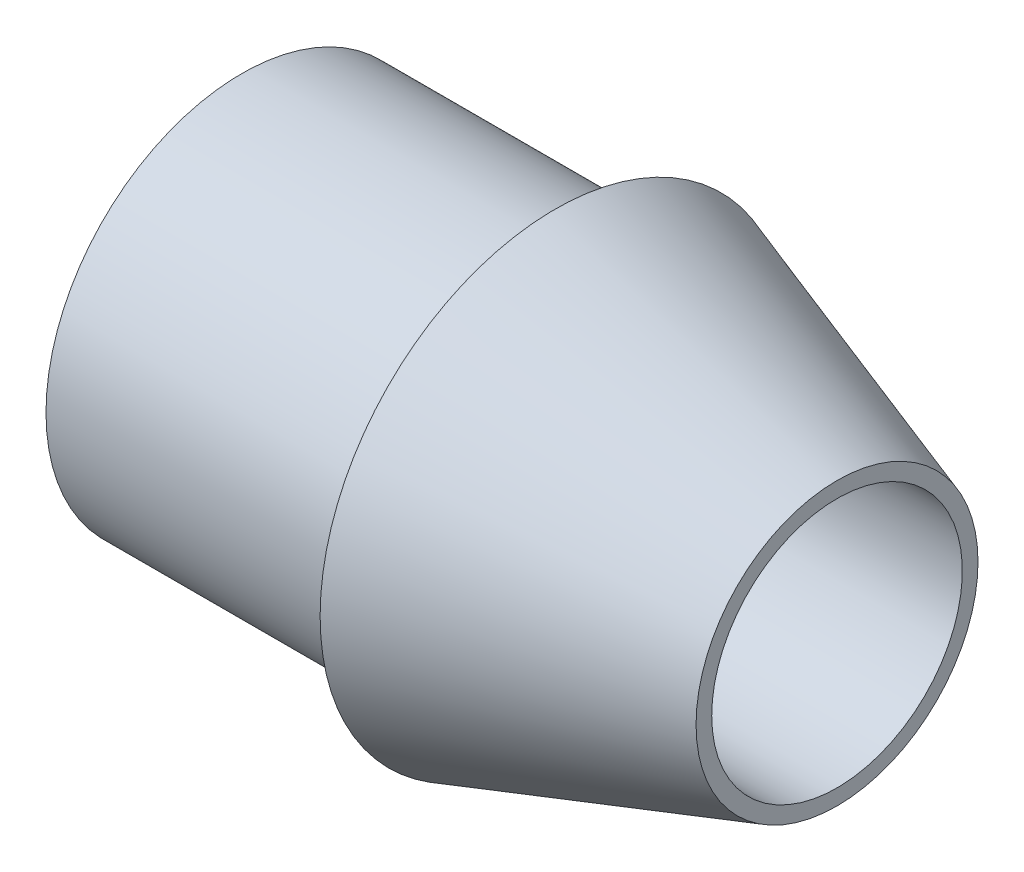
ISO-10303-21;
HEADER;
FILE_DESCRIPTION(('STEP AP214'),'2;1');
FILE_NAME('part.step','',(''),(''),'','','');
FILE_SCHEMA(('AUTOMOTIVE_DESIGN { 1 0 10303 214 1 1 1 1 }'));
ENDSEC;
DATA;
#1=APPLICATION_CONTEXT('core data for automotive mechanical design processes');
#2=APPLICATION_PROTOCOL_DEFINITION('international standard','automotive_design',2000,#1);
#3=PRODUCT_CONTEXT('',#1,'mechanical');
#4=PRODUCT('Part','Part','',(#3));
#5=PRODUCT_RELATED_PRODUCT_CATEGORY('part','',(#4));
#6=PRODUCT_DEFINITION_FORMATION('','',#4);
#7=PRODUCT_DEFINITION_CONTEXT('part definition',#1,'design');
#8=PRODUCT_DEFINITION('design','',#6,#7);
#9=PRODUCT_DEFINITION_SHAPE('','',#8);
#10=(LENGTH_UNIT() NAMED_UNIT(*) SI_UNIT(.MILLI.,.METRE.));
#11=(NAMED_UNIT(*) PLANE_ANGLE_UNIT() SI_UNIT($,.RADIAN.));
#12=(NAMED_UNIT(*) SI_UNIT($,.STERADIAN.) SOLID_ANGLE_UNIT());
#13=UNCERTAINTY_MEASURE_WITH_UNIT(LENGTH_MEASURE(1.E-05),#10,'distance_accuracy_value','');
#14=(GEOMETRIC_REPRESENTATION_CONTEXT(3) GLOBAL_UNCERTAINTY_ASSIGNED_CONTEXT((#13)) GLOBAL_UNIT_ASSIGNED_CONTEXT((#10,
#11,#12)) REPRESENTATION_CONTEXT('',''));
#15=CARTESIAN_POINT('',(0.,0.,0.));
#16=DIRECTION('',(0.,0.,1.));
#17=DIRECTION('',(1.,0.,0.));
#18=AXIS2_PLACEMENT_3D('',#15,#16,#17);
#19=CARTESIAN_POINT('',(-22.5,0.,0.));
#20=DIRECTION('',(1.,0.,0.));
#21=DIRECTION('',(0.,0.,-1.));
#22=AXIS2_PLACEMENT_3D('',#19,#20,#21);
#23=PLANE('',#22);
#24=CARTESIAN_POINT('',(-22.5,0.,0.));
#25=DIRECTION('',(-1.,0.,0.));
#26=DIRECTION('',(0.,0.,1.));
#27=AXIS2_PLACEMENT_3D('',#24,#25,#26);
#28=CIRCLE('',#27,7.5);
#29=CARTESIAN_POINT('',(-22.5,0.,7.5));
#30=VERTEX_POINT('',#29);
#31=EDGE_CURVE('E36',#30,#30,#28,.T.);
#32=ORIENTED_EDGE('',*,*,#31,.T.);
#33=EDGE_LOOP('',(#32));
#34=FACE_BOUND('',#33,.T.);
#35=CARTESIAN_POINT('',(-22.5,0.,0.));
#36=DIRECTION('',(1.,0.,0.));
#37=DIRECTION('',(0.,0.,-1.));
#38=AXIS2_PLACEMENT_3D('',#35,#36,#37);
#39=CIRCLE('',#38,6.25);
#40=CARTESIAN_POINT('',(-22.5,0.,-6.25));
#41=VERTEX_POINT('',#40);
#42=EDGE_CURVE('E10',#41,#41,#39,.F.);
#43=ORIENTED_EDGE('',*,*,#42,.F.);
#44=EDGE_LOOP('',(#43));
#45=FACE_BOUND('',#44,.T.);
#46=ADVANCED_FACE('F29',(#34,#45),#23,.F.);
#47=CARTESIAN_POINT('',(0.,0.,0.));
#48=DIRECTION('',(-1.,0.,0.));
#49=DIRECTION('',(0.,0.,1.));
#50=AXIS2_PLACEMENT_3D('',#47,#48,#49);
#51=CONICAL_SURFACE('',#50,0.,0.321750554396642);
#52=ORIENTED_EDGE('',*,*,#31,.F.);
#53=EDGE_LOOP('',(#52));
#54=FACE_BOUND('',#53,.T.);
#55=CARTESIAN_POINT('',(-13.5,0.,0.));
#56=DIRECTION('',(1.,0.,0.));
#57=DIRECTION('',(0.,0.,-1.));
#58=AXIS2_PLACEMENT_3D('',#55,#56,#57);
#59=CIRCLE('',#58,4.5);
#60=CARTESIAN_POINT('',(-13.5,0.,-4.5));
#61=VERTEX_POINT('',#60);
#62=EDGE_CURVE('E40',#61,#61,#59,.T.);
#63=ORIENTED_EDGE('',*,*,#62,.F.);
#64=EDGE_LOOP('',(#63));
#65=FACE_BOUND('',#64,.T.);
#66=ADVANCED_FACE('F31',(#54,#65),#51,.T.);
#67=CARTESIAN_POINT('',(-13.5,0.,0.));
#68=DIRECTION('',(1.,0.,0.));
#69=DIRECTION('',(0.,0.,-1.));
#70=AXIS2_PLACEMENT_3D('',#67,#68,#69);
#71=PLANE('',#70);
#72=CARTESIAN_POINT('',(-13.5,0.,0.));
#73=DIRECTION('',(-1.,0.,0.));
#74=DIRECTION('',(0.,0.,1.));
#75=AXIS2_PLACEMENT_3D('',#72,#73,#74);
#76=CIRCLE('',#75,4.);
#77=CARTESIAN_POINT('',(-13.5,0.,4.));
#78=VERTEX_POINT('',#77);
#79=EDGE_CURVE('E49',#78,#78,#76,.T.);
#80=ORIENTED_EDGE('',*,*,#79,.T.);
#81=EDGE_LOOP('',(#80));
#82=FACE_BOUND('',#81,.T.);
#83=ORIENTED_EDGE('',*,*,#62,.T.);
#84=EDGE_LOOP('',(#83));
#85=FACE_BOUND('',#84,.T.);
#86=ADVANCED_FACE('F66',(#82,#85),#71,.T.);
#87=CARTESIAN_POINT('',(-32.5,0.,0.));
#88=DIRECTION('',(1.,0.,0.));
#89=DIRECTION('',(0.,0.,-1.));
#90=AXIS2_PLACEMENT_3D('',#87,#88,#89);
#91=CYLINDRICAL_SURFACE('',#90,6.25);
#92=CARTESIAN_POINT('',(-32.5,0.,0.));
#93=DIRECTION('',(-1.,0.,0.));
#94=DIRECTION('',(0.,0.,1.));
#95=AXIS2_PLACEMENT_3D('',#92,#93,#94);
#96=CIRCLE('',#95,6.25);
#97=CARTESIAN_POINT('',(-32.5,0.,6.25));
#98=VERTEX_POINT('',#97);
#99=EDGE_CURVE('E45',#98,#98,#96,.T.);
#100=ORIENTED_EDGE('',*,*,#99,.F.);
#101=EDGE_LOOP('',(#100));
#102=FACE_BOUND('',#101,.T.);
#103=ORIENTED_EDGE('',*,*,#42,.T.);
#104=EDGE_LOOP('',(#103));
#105=FACE_BOUND('',#104,.T.);
#106=ADVANCED_FACE('F61',(#102,#105),#91,.T.);
#107=CARTESIAN_POINT('',(-32.5,0.,0.));
#108=DIRECTION('',(-1.,0.,0.));
#109=DIRECTION('',(0.,0.,1.));
#110=AXIS2_PLACEMENT_3D('',#107,#108,#109);
#111=PLANE('',#110);
#112=CARTESIAN_POINT('',(-32.5,0.,0.));
#113=DIRECTION('',(-1.,0.,0.));
#114=DIRECTION('',(0.,0.,1.));
#115=AXIS2_PLACEMENT_3D('',#112,#113,#114);
#116=CIRCLE('',#115,4.);
#117=CARTESIAN_POINT('',(-32.5,0.,4.));
#118=VERTEX_POINT('',#117);
#119=EDGE_CURVE('E52',#118,#118,#116,.T.);
#120=ORIENTED_EDGE('',*,*,#119,.F.);
#121=EDGE_LOOP('',(#120));
#122=FACE_BOUND('',#121,.T.);
#123=ORIENTED_EDGE('',*,*,#99,.T.);
#124=EDGE_LOOP('',(#123));
#125=FACE_BOUND('',#124,.T.);
#126=ADVANCED_FACE('F58',(#122,#125),#111,.T.);
#127=CARTESIAN_POINT('',(-13.5,0.,0.));
#128=DIRECTION('',(-1.,0.,0.));
#129=DIRECTION('',(0.,0.,1.));
#130=AXIS2_PLACEMENT_3D('',#127,#128,#129);
#131=CYLINDRICAL_SURFACE('',#130,4.);
#132=ORIENTED_EDGE('',*,*,#79,.F.);
#133=EDGE_LOOP('',(#132));
#134=FACE_BOUND('',#133,.T.);
#135=ORIENTED_EDGE('',*,*,#119,.T.);
#136=EDGE_LOOP('',(#135));
#137=FACE_BOUND('',#136,.T.);
#138=ADVANCED_FACE('F56',(#134,#137),#131,.F.);
#139=CLOSED_SHELL('',(#46,#66,#86,#106,#126,#138));
#140=MANIFOLD_SOLID_BREP('B2',#139);
#141=ADVANCED_BREP_SHAPE_REPRESENTATION('',(#18,#140),#14);
#142=SHAPE_DEFINITION_REPRESENTATION(#9,#141);
ENDSEC;
END-ISO-10303-21;
